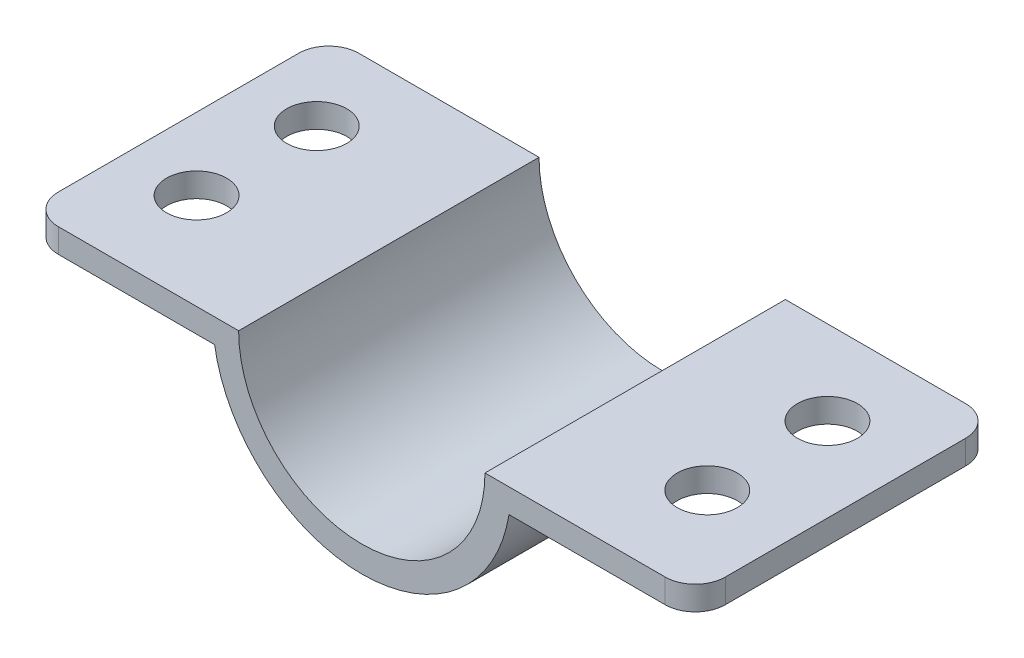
ISO-10303-21;
HEADER;
FILE_DESCRIPTION(('STEP AP214'),'2;1');
FILE_NAME('part.step','',(''),(''),'','','');
FILE_SCHEMA(('AUTOMOTIVE_DESIGN { 1 0 10303 214 1 1 1 1 }'));
ENDSEC;
DATA;
#1=APPLICATION_CONTEXT('core data for automotive mechanical design processes');
#2=APPLICATION_PROTOCOL_DEFINITION('international standard','automotive_design',2000,#1);
#3=PRODUCT_CONTEXT('',#1,'mechanical');
#4=PRODUCT('Part','Part','',(#3));
#5=PRODUCT_RELATED_PRODUCT_CATEGORY('part','',(#4));
#6=PRODUCT_DEFINITION_FORMATION('','',#4);
#7=PRODUCT_DEFINITION_CONTEXT('part definition',#1,'design');
#8=PRODUCT_DEFINITION('design','',#6,#7);
#9=PRODUCT_DEFINITION_SHAPE('','',#8);
#10=(LENGTH_UNIT() NAMED_UNIT(*) SI_UNIT(.MILLI.,.METRE.));
#11=(NAMED_UNIT(*) PLANE_ANGLE_UNIT() SI_UNIT($,.RADIAN.));
#12=(NAMED_UNIT(*) SI_UNIT($,.STERADIAN.) SOLID_ANGLE_UNIT());
#13=UNCERTAINTY_MEASURE_WITH_UNIT(LENGTH_MEASURE(1.E-05),#10,'distance_accuracy_value','');
#14=(GEOMETRIC_REPRESENTATION_CONTEXT(3) GLOBAL_UNCERTAINTY_ASSIGNED_CONTEXT((#13)) GLOBAL_UNIT_ASSIGNED_CONTEXT((#10,
#11,#12)) REPRESENTATION_CONTEXT('',''));
#15=CARTESIAN_POINT('',(0.,0.,0.));
#16=DIRECTION('',(0.,0.,1.));
#17=DIRECTION('',(1.,0.,0.));
#18=AXIS2_PLACEMENT_3D('',#15,#16,#17);
#19=CARTESIAN_POINT('',(-27.75,0.,12.5));
#20=DIRECTION('',(1.,0.,0.));
#21=DIRECTION('',(0.,0.,-1.));
#22=AXIS2_PLACEMENT_3D('',#19,#20,#21);
#23=PLANE('',#22);
#24=DIRECTION('',(0.,0.,-1.));
#25=VECTOR('',#24,1.);
#26=CARTESIAN_POINT('',(-27.75,-2.,12.5));
#27=LINE('',#26,#25);
#28=CARTESIAN_POINT('',(-27.75,-2.,10.));
#29=VERTEX_POINT('',#28);
#30=CARTESIAN_POINT('',(-27.75,-2.,-10.));
#31=VERTEX_POINT('',#30);
#32=EDGE_CURVE('E147',#29,#31,#27,.T.);
#33=ORIENTED_EDGE('',*,*,#32,.F.);
#34=DIRECTION('',(0.,-1.,0.));
#35=VECTOR('',#34,1.);
#36=CARTESIAN_POINT('',(-27.75,0.,10.));
#37=LINE('',#36,#35);
#38=CARTESIAN_POINT('',(-27.75,0.,10.));
#39=VERTEX_POINT('',#38);
#40=EDGE_CURVE('E59',#29,#39,#37,.F.);
#41=ORIENTED_EDGE('',*,*,#40,.T.);
#42=DIRECTION('',(0.,0.,-1.));
#43=VECTOR('',#42,1.);
#44=CARTESIAN_POINT('',(-27.75,0.,12.5));
#45=LINE('',#44,#43);
#46=CARTESIAN_POINT('',(-27.75,0.,-10.));
#47=VERTEX_POINT('',#46);
#48=EDGE_CURVE('E164',#39,#47,#45,.T.);
#49=ORIENTED_EDGE('',*,*,#48,.T.);
#50=DIRECTION('',(0.,-1.,0.));
#51=VECTOR('',#50,1.);
#52=CARTESIAN_POINT('',(-27.75,0.,-10.));
#53=LINE('',#52,#51);
#54=EDGE_CURVE('E218',#47,#31,#53,.T.);
#55=ORIENTED_EDGE('',*,*,#54,.T.);
#56=EDGE_LOOP('',(#33,#41,#49,#55));
#57=FACE_BOUND('',#56,.T.);
#58=ADVANCED_FACE('F38',(#57),#23,.F.);
#59=CARTESIAN_POINT('',(-27.75,-2.,12.5));
#60=DIRECTION('',(0.,1.,0.));
#61=DIRECTION('',(0.,0.,1.));
#62=AXIS2_PLACEMENT_3D('',#59,#60,#61);
#63=PLANE('',#62);
#64=CARTESIAN_POINT('',(-21.75,-2.,4.5));
#65=DIRECTION('',(0.,1.,0.));
#66=DIRECTION('',(0.,0.,1.));
#67=AXIS2_PLACEMENT_3D('',#64,#65,#66);
#68=CIRCLE('',#67,2.49999999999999);
#69=CARTESIAN_POINT('',(-21.75,-2.,6.99999999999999));
#70=VERTEX_POINT('',#69);
#71=EDGE_CURVE('E433',#70,#70,#68,.T.);
#72=ORIENTED_EDGE('',*,*,#71,.T.);
#73=EDGE_LOOP('',(#72));
#74=FACE_BOUND('',#73,.T.);
#75=CARTESIAN_POINT('',(-21.75,-2.,-5.5));
#76=DIRECTION('',(0.,1.,0.));
#77=DIRECTION('',(0.,0.,1.));
#78=AXIS2_PLACEMENT_3D('',#75,#76,#77);
#79=CIRCLE('',#78,2.49999999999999);
#80=CARTESIAN_POINT('',(-21.75,-2.,-3.00000000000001));
#81=VERTEX_POINT('',#80);
#82=EDGE_CURVE('E167',#81,#81,#79,.T.);
#83=ORIENTED_EDGE('',*,*,#82,.T.);
#84=EDGE_LOOP('',(#83));
#85=FACE_BOUND('',#84,.T.);
#86=DIRECTION('',(1.,0.,0.));
#87=VECTOR('',#86,1.);
#88=CARTESIAN_POINT('',(-27.75,-2.,12.5));
#89=LINE('',#88,#87);
#90=CARTESIAN_POINT('',(-25.25,-2.,12.5));
#91=VERTEX_POINT('',#90);
#92=CARTESIAN_POINT('',(-12.25,-1.99999999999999,12.5));
#93=VERTEX_POINT('',#92);
#94=EDGE_CURVE('E127',#91,#93,#89,.T.);
#95=ORIENTED_EDGE('',*,*,#94,.F.);
#96=CARTESIAN_POINT('',(-25.25,-2.,10.));
#97=DIRECTION('',(0.,1.,0.));
#98=DIRECTION('',(0.,0.,1.));
#99=AXIS2_PLACEMENT_3D('',#96,#97,#98);
#100=CIRCLE('',#99,2.5);
#101=EDGE_CURVE('E216',#91,#29,#100,.F.);
#102=ORIENTED_EDGE('',*,*,#101,.T.);
#103=ORIENTED_EDGE('',*,*,#32,.T.);
#104=CARTESIAN_POINT('',(-25.25,-2.,-10.));
#105=DIRECTION('',(0.,1.,0.));
#106=DIRECTION('',(0.,0.,1.));
#107=AXIS2_PLACEMENT_3D('',#104,#105,#106);
#108=CIRCLE('',#107,2.5);
#109=CARTESIAN_POINT('',(-25.25,-2.,-12.5));
#110=VERTEX_POINT('',#109);
#111=EDGE_CURVE('E214',#31,#110,#108,.F.);
#112=ORIENTED_EDGE('',*,*,#111,.T.);
#113=DIRECTION('',(1.,0.,0.));
#114=VECTOR('',#113,1.);
#115=CARTESIAN_POINT('',(-27.75,-2.,-12.5));
#116=LINE('',#115,#114);
#117=CARTESIAN_POINT('',(-12.25,-1.99999999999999,-12.5));
#118=VERTEX_POINT('',#117);
#119=EDGE_CURVE('E144',#110,#118,#116,.T.);
#120=ORIENTED_EDGE('',*,*,#119,.T.);
#121=DIRECTION('',(0.,0.,-1.));
#122=VECTOR('',#121,1.);
#123=CARTESIAN_POINT('',(-12.25,-1.99999999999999,12.5));
#124=LINE('',#123,#122);
#125=EDGE_CURVE('E141',#93,#118,#124,.T.);
#126=ORIENTED_EDGE('',*,*,#125,.F.);
#127=EDGE_LOOP('',(#95,#102,#103,#112,#120,#126));
#128=FACE_BOUND('',#127,.T.);
#129=ADVANCED_FACE('F142',(#74,#85,#128),#63,.F.);
#130=CARTESIAN_POINT('',(0.,0.,12.5));
#131=DIRECTION('',(0.,0.,-1.));
#132=DIRECTION('',(-1.,0.,0.));
#133=AXIS2_PLACEMENT_3D('',#130,#131,#132);
#134=CYLINDRICAL_SURFACE('',#133,12.4121915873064);
#135=CARTESIAN_POINT('',(0.,0.,-12.5));
#136=DIRECTION('',(0.,0.,1.));
#137=DIRECTION('',(1.,0.,0.));
#138=AXIS2_PLACEMENT_3D('',#135,#136,#137);
#139=CIRCLE('',#138,12.4121915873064);
#140=CARTESIAN_POINT('',(12.25,-2.,-12.5));
#141=VERTEX_POINT('',#140);
#142=EDGE_CURVE('E166',#118,#141,#139,.T.);
#143=ORIENTED_EDGE('',*,*,#142,.T.);
#144=DIRECTION('',(0.,0.,-1.));
#145=VECTOR('',#144,1.);
#146=CARTESIAN_POINT('',(12.25,-2.,12.5));
#147=LINE('',#146,#145);
#148=CARTESIAN_POINT('',(12.25,-2.,12.5));
#149=VERTEX_POINT('',#148);
#150=EDGE_CURVE('E148',#149,#141,#147,.T.);
#151=ORIENTED_EDGE('',*,*,#150,.F.);
#152=CARTESIAN_POINT('',(0.,0.,12.5));
#153=DIRECTION('',(0.,0.,1.));
#154=DIRECTION('',(1.,0.,0.));
#155=AXIS2_PLACEMENT_3D('',#152,#153,#154);
#156=CIRCLE('',#155,12.4121915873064);
#157=EDGE_CURVE('E132',#93,#149,#156,.T.);
#158=ORIENTED_EDGE('',*,*,#157,.F.);
#159=ORIENTED_EDGE('',*,*,#125,.T.);
#160=EDGE_LOOP('',(#143,#151,#158,#159));
#161=FACE_BOUND('',#160,.T.);
#162=ADVANCED_FACE('F150',(#161),#134,.T.);
#163=CARTESIAN_POINT('',(27.75,-2.,12.5));
#164=DIRECTION('',(0.,1.,0.));
#165=DIRECTION('',(0.,0.,1.));
#166=AXIS2_PLACEMENT_3D('',#163,#164,#165);
#167=PLANE('',#166);
#168=CARTESIAN_POINT('',(20.75,-2.,4.5));
#169=DIRECTION('',(0.,1.,0.));
#170=DIRECTION('',(0.,0.,1.));
#171=AXIS2_PLACEMENT_3D('',#168,#169,#170);
#172=CIRCLE('',#171,2.5);
#173=CARTESIAN_POINT('',(20.75,-2.,7.));
#174=VERTEX_POINT('',#173);
#175=EDGE_CURVE('E447',#174,#174,#172,.T.);
#176=ORIENTED_EDGE('',*,*,#175,.T.);
#177=EDGE_LOOP('',(#176));
#178=FACE_BOUND('',#177,.T.);
#179=CARTESIAN_POINT('',(20.75,-2.,-5.5));
#180=DIRECTION('',(0.,1.,0.));
#181=DIRECTION('',(0.,0.,1.));
#182=AXIS2_PLACEMENT_3D('',#179,#180,#181);
#183=CIRCLE('',#182,2.5);
#184=CARTESIAN_POINT('',(20.75,-2.,-3.));
#185=VERTEX_POINT('',#184);
#186=EDGE_CURVE('E441',#185,#185,#183,.T.);
#187=ORIENTED_EDGE('',*,*,#186,.T.);
#188=EDGE_LOOP('',(#187));
#189=FACE_BOUND('',#188,.T.);
#190=DIRECTION('',(0.,0.,-1.));
#191=VECTOR('',#190,1.);
#192=CARTESIAN_POINT('',(27.75,-2.,12.5));
#193=LINE('',#192,#191);
#194=CARTESIAN_POINT('',(27.75,-2.,10.));
#195=VERTEX_POINT('',#194);
#196=CARTESIAN_POINT('',(27.75,-2.,-10.));
#197=VERTEX_POINT('',#196);
#198=EDGE_CURVE('E187',#195,#197,#193,.T.);
#199=ORIENTED_EDGE('',*,*,#198,.F.);
#200=CARTESIAN_POINT('',(25.25,-2.,10.));
#201=DIRECTION('',(0.,1.,0.));
#202=DIRECTION('',(0.,0.,1.));
#203=AXIS2_PLACEMENT_3D('',#200,#201,#202);
#204=CIRCLE('',#203,2.5);
#205=CARTESIAN_POINT('',(25.25,-2.,12.5));
#206=VERTEX_POINT('',#205);
#207=EDGE_CURVE('E208',#195,#206,#204,.F.);
#208=ORIENTED_EDGE('',*,*,#207,.T.);
#209=DIRECTION('',(1.,0.,0.));
#210=VECTOR('',#209,1.);
#211=CARTESIAN_POINT('',(27.75,-2.,12.5));
#212=LINE('',#211,#210);
#213=EDGE_CURVE('E153',#149,#206,#212,.T.);
#214=ORIENTED_EDGE('',*,*,#213,.F.);
#215=ORIENTED_EDGE('',*,*,#150,.T.);
#216=DIRECTION('',(1.,0.,0.));
#217=VECTOR('',#216,1.);
#218=CARTESIAN_POINT('',(27.75,-2.,-12.5));
#219=LINE('',#218,#217);
#220=CARTESIAN_POINT('',(25.25,-2.,-12.5));
#221=VERTEX_POINT('',#220);
#222=EDGE_CURVE('E169',#141,#221,#219,.T.);
#223=ORIENTED_EDGE('',*,*,#222,.T.);
#224=CARTESIAN_POINT('',(25.25,-2.,-10.));
#225=DIRECTION('',(0.,1.,0.));
#226=DIRECTION('',(0.,0.,1.));
#227=AXIS2_PLACEMENT_3D('',#224,#225,#226);
#228=CIRCLE('',#227,2.5);
#229=EDGE_CURVE('E206',#221,#197,#228,.F.);
#230=ORIENTED_EDGE('',*,*,#229,.T.);
#231=EDGE_LOOP('',(#199,#208,#214,#215,#223,#230));
#232=FACE_BOUND('',#231,.T.);
#233=ADVANCED_FACE('F268',(#178,#189,#232),#167,.F.);
#234=CARTESIAN_POINT('',(27.75,0.,12.5));
#235=DIRECTION('',(-1.,0.,0.));
#236=DIRECTION('',(0.,0.,1.));
#237=AXIS2_PLACEMENT_3D('',#234,#235,#236);
#238=PLANE('',#237);
#239=DIRECTION('',(0.,0.,-1.));
#240=VECTOR('',#239,1.);
#241=CARTESIAN_POINT('',(27.75,0.,12.5));
#242=LINE('',#241,#240);
#243=CARTESIAN_POINT('',(27.75,0.,10.));
#244=VERTEX_POINT('',#243);
#245=CARTESIAN_POINT('',(27.75,0.,-10.));
#246=VERTEX_POINT('',#245);
#247=EDGE_CURVE('E184',#244,#246,#242,.T.);
#248=ORIENTED_EDGE('',*,*,#247,.F.);
#249=DIRECTION('',(0.,1.,0.));
#250=VECTOR('',#249,1.);
#251=CARTESIAN_POINT('',(27.75,-2.,10.));
#252=LINE('',#251,#250);
#253=EDGE_CURVE('E204',#244,#195,#252,.F.);
#254=ORIENTED_EDGE('',*,*,#253,.T.);
#255=ORIENTED_EDGE('',*,*,#198,.T.);
#256=DIRECTION('',(0.,1.,0.));
#257=VECTOR('',#256,1.);
#258=CARTESIAN_POINT('',(27.75,0.,-10.));
#259=LINE('',#258,#257);
#260=EDGE_CURVE('E201',#197,#246,#259,.T.);
#261=ORIENTED_EDGE('',*,*,#260,.T.);
#262=EDGE_LOOP('',(#248,#254,#255,#261));
#263=FACE_BOUND('',#262,.T.);
#264=ADVANCED_FACE('F273',(#263),#238,.F.);
#265=CARTESIAN_POINT('',(10.25,0.,12.5));
#266=DIRECTION('',(0.,-1.,0.));
#267=DIRECTION('',(0.,0.,-1.));
#268=AXIS2_PLACEMENT_3D('',#265,#266,#267);
#269=PLANE('',#268);
#270=CARTESIAN_POINT('',(20.75,0.,4.5));
#271=DIRECTION('',(0.,1.,0.));
#272=DIRECTION('',(0.,0.,1.));
#273=AXIS2_PLACEMENT_3D('',#270,#271,#272);
#274=CIRCLE('',#273,2.5);
#275=CARTESIAN_POINT('',(20.75,0.,7.));
#276=VERTEX_POINT('',#275);
#277=EDGE_CURVE('E450',#276,#276,#274,.T.);
#278=ORIENTED_EDGE('',*,*,#277,.F.);
#279=EDGE_LOOP('',(#278));
#280=FACE_BOUND('',#279,.T.);
#281=CARTESIAN_POINT('',(20.75,0.,-5.5));
#282=DIRECTION('',(0.,1.,0.));
#283=DIRECTION('',(0.,0.,1.));
#284=AXIS2_PLACEMENT_3D('',#281,#282,#283);
#285=CIRCLE('',#284,2.5);
#286=CARTESIAN_POINT('',(20.75,0.,-3.));
#287=VERTEX_POINT('',#286);
#288=EDGE_CURVE('E444',#287,#287,#285,.T.);
#289=ORIENTED_EDGE('',*,*,#288,.F.);
#290=EDGE_LOOP('',(#289));
#291=FACE_BOUND('',#290,.T.);
#292=DIRECTION('',(-1.,0.,0.));
#293=VECTOR('',#292,1.);
#294=CARTESIAN_POINT('',(10.25,0.,12.5));
#295=LINE('',#294,#293);
#296=CARTESIAN_POINT('',(25.25,0.,12.5));
#297=VERTEX_POINT('',#296);
#298=CARTESIAN_POINT('',(10.25,0.,12.5));
#299=VERTEX_POINT('',#298);
#300=EDGE_CURVE('E155',#297,#299,#295,.T.);
#301=ORIENTED_EDGE('',*,*,#300,.F.);
#302=CARTESIAN_POINT('',(25.25,0.,10.));
#303=DIRECTION('',(0.,-1.,0.));
#304=DIRECTION('',(0.,0.,-1.));
#305=AXIS2_PLACEMENT_3D('',#302,#303,#304);
#306=CIRCLE('',#305,2.5);
#307=EDGE_CURVE('E199',#297,#244,#306,.F.);
#308=ORIENTED_EDGE('',*,*,#307,.T.);
#309=ORIENTED_EDGE('',*,*,#247,.T.);
#310=CARTESIAN_POINT('',(25.25,0.,-10.));
#311=DIRECTION('',(0.,-1.,0.));
#312=DIRECTION('',(0.,0.,-1.));
#313=AXIS2_PLACEMENT_3D('',#310,#311,#312);
#314=CIRCLE('',#313,2.5);
#315=CARTESIAN_POINT('',(25.25,0.,-12.5));
#316=VERTEX_POINT('',#315);
#317=EDGE_CURVE('E197',#246,#316,#314,.F.);
#318=ORIENTED_EDGE('',*,*,#317,.T.);
#319=DIRECTION('',(-1.,0.,0.));
#320=VECTOR('',#319,1.);
#321=CARTESIAN_POINT('',(10.25,0.,-12.5));
#322=LINE('',#321,#320);
#323=CARTESIAN_POINT('',(10.25,0.,-12.5));
#324=VERTEX_POINT('',#323);
#325=EDGE_CURVE('E172',#316,#324,#322,.T.);
#326=ORIENTED_EDGE('',*,*,#325,.T.);
#327=DIRECTION('',(0.,0.,-1.));
#328=VECTOR('',#327,1.);
#329=CARTESIAN_POINT('',(10.25,0.,12.5));
#330=LINE('',#329,#328);
#331=EDGE_CURVE('E181',#299,#324,#330,.T.);
#332=ORIENTED_EDGE('',*,*,#331,.F.);
#333=EDGE_LOOP('',(#301,#308,#309,#318,#326,#332));
#334=FACE_BOUND('',#333,.T.);
#335=ADVANCED_FACE('F277',(#280,#291,#334),#269,.F.);
#336=CARTESIAN_POINT('',(0.,0.,12.5));
#337=DIRECTION('',(0.,0.,-1.));
#338=DIRECTION('',(-1.,0.,0.));
#339=AXIS2_PLACEMENT_3D('',#336,#337,#338);
#340=CYLINDRICAL_SURFACE('',#339,10.25);
#341=CARTESIAN_POINT('',(0.,0.,-12.5));
#342=DIRECTION('',(0.,0.,-1.));
#343=DIRECTION('',(1.,0.,0.));
#344=AXIS2_PLACEMENT_3D('',#341,#342,#343);
#345=CIRCLE('',#344,10.25);
#346=CARTESIAN_POINT('',(-10.25,0.,-12.5));
#347=VERTEX_POINT('',#346);
#348=EDGE_CURVE('E174',#324,#347,#345,.T.);
#349=ORIENTED_EDGE('',*,*,#348,.T.);
#350=DIRECTION('',(0.,0.,-1.));
#351=VECTOR('',#350,1.);
#352=CARTESIAN_POINT('',(-10.25,0.,12.5));
#353=LINE('',#352,#351);
#354=CARTESIAN_POINT('',(-10.25,0.,12.5));
#355=VERTEX_POINT('',#354);
#356=EDGE_CURVE('E178',#355,#347,#353,.T.);
#357=ORIENTED_EDGE('',*,*,#356,.F.);
#358=CARTESIAN_POINT('',(0.,0.,12.5));
#359=DIRECTION('',(0.,0.,-1.));
#360=DIRECTION('',(1.,0.,0.));
#361=AXIS2_PLACEMENT_3D('',#358,#359,#360);
#362=CIRCLE('',#361,10.25);
#363=EDGE_CURVE('E160',#299,#355,#362,.T.);
#364=ORIENTED_EDGE('',*,*,#363,.F.);
#365=ORIENTED_EDGE('',*,*,#331,.T.);
#366=EDGE_LOOP('',(#349,#357,#364,#365));
#367=FACE_BOUND('',#366,.T.);
#368=ADVANCED_FACE('F233',(#367),#340,.F.);
#369=CARTESIAN_POINT('',(-27.75,0.,12.5));
#370=DIRECTION('',(0.,-1.,0.));
#371=DIRECTION('',(0.,0.,-1.));
#372=AXIS2_PLACEMENT_3D('',#369,#370,#371);
#373=PLANE('',#372);
#374=CARTESIAN_POINT('',(-21.75,0.,4.5));
#375=DIRECTION('',(0.,1.,0.));
#376=DIRECTION('',(0.,0.,1.));
#377=AXIS2_PLACEMENT_3D('',#374,#375,#376);
#378=CIRCLE('',#377,2.49999999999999);
#379=CARTESIAN_POINT('',(-21.75,0.,6.99999999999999));
#380=VERTEX_POINT('',#379);
#381=EDGE_CURVE('E438',#380,#380,#378,.T.);
#382=ORIENTED_EDGE('',*,*,#381,.F.);
#383=EDGE_LOOP('',(#382));
#384=FACE_BOUND('',#383,.T.);
#385=CARTESIAN_POINT('',(-21.75,0.,-5.5));
#386=DIRECTION('',(0.,1.,0.));
#387=DIRECTION('',(0.,0.,1.));
#388=AXIS2_PLACEMENT_3D('',#385,#386,#387);
#389=CIRCLE('',#388,2.49999999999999);
#390=CARTESIAN_POINT('',(-21.75,0.,-3.00000000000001));
#391=VERTEX_POINT('',#390);
#392=EDGE_CURVE('E429',#391,#391,#389,.T.);
#393=ORIENTED_EDGE('',*,*,#392,.F.);
#394=EDGE_LOOP('',(#393));
#395=FACE_BOUND('',#394,.T.);
#396=ORIENTED_EDGE('',*,*,#48,.F.);
#397=CARTESIAN_POINT('',(-25.25,0.,10.));
#398=DIRECTION('',(0.,-1.,0.));
#399=DIRECTION('',(0.,0.,-1.));
#400=AXIS2_PLACEMENT_3D('',#397,#398,#399);
#401=CIRCLE('',#400,2.5);
#402=CARTESIAN_POINT('',(-25.25,0.,12.5));
#403=VERTEX_POINT('',#402);
#404=EDGE_CURVE('E11',#39,#403,#401,.F.);
#405=ORIENTED_EDGE('',*,*,#404,.T.);
#406=DIRECTION('',(-1.,0.,0.));
#407=VECTOR('',#406,1.);
#408=CARTESIAN_POINT('',(-27.75,0.,12.5));
#409=LINE('',#408,#407);
#410=EDGE_CURVE('E162',#355,#403,#409,.T.);
#411=ORIENTED_EDGE('',*,*,#410,.F.);
#412=ORIENTED_EDGE('',*,*,#356,.T.);
#413=DIRECTION('',(-1.,0.,0.));
#414=VECTOR('',#413,1.);
#415=CARTESIAN_POINT('',(-27.75,0.,-12.5));
#416=LINE('',#415,#414);
#417=CARTESIAN_POINT('',(-25.25,0.,-12.5));
#418=VERTEX_POINT('',#417);
#419=EDGE_CURVE('E138',#347,#418,#416,.T.);
#420=ORIENTED_EDGE('',*,*,#419,.T.);
#421=CARTESIAN_POINT('',(-25.25,0.,-10.));
#422=DIRECTION('',(0.,-1.,0.));
#423=DIRECTION('',(0.,0.,-1.));
#424=AXIS2_PLACEMENT_3D('',#421,#422,#423);
#425=CIRCLE('',#424,2.5);
#426=EDGE_CURVE('E46',#418,#47,#425,.F.);
#427=ORIENTED_EDGE('',*,*,#426,.T.);
#428=EDGE_LOOP('',(#396,#405,#411,#412,#420,#427));
#429=FACE_BOUND('',#428,.T.);
#430=ADVANCED_FACE('F227',(#384,#395,#429),#373,.F.);
#431=CARTESIAN_POINT('',(0.,0.,12.5));
#432=DIRECTION('',(0.,0.,1.));
#433=DIRECTION('',(1.,0.,0.));
#434=AXIS2_PLACEMENT_3D('',#431,#432,#433);
#435=PLANE('',#434);
#436=ORIENTED_EDGE('',*,*,#213,.T.);
#437=DIRECTION('',(0.,1.,0.));
#438=VECTOR('',#437,1.);
#439=CARTESIAN_POINT('',(25.25,0.,12.5));
#440=LINE('',#439,#438);
#441=EDGE_CURVE('E194',#206,#297,#440,.T.);
#442=ORIENTED_EDGE('',*,*,#441,.T.);
#443=ORIENTED_EDGE('',*,*,#300,.T.);
#444=ORIENTED_EDGE('',*,*,#363,.T.);
#445=ORIENTED_EDGE('',*,*,#410,.T.);
#446=DIRECTION('',(0.,-1.,0.));
#447=VECTOR('',#446,1.);
#448=CARTESIAN_POINT('',(-25.25,-2.,12.5));
#449=LINE('',#448,#447);
#450=EDGE_CURVE('E136',#403,#91,#449,.T.);
#451=ORIENTED_EDGE('',*,*,#450,.T.);
#452=ORIENTED_EDGE('',*,*,#94,.T.);
#453=ORIENTED_EDGE('',*,*,#157,.T.);
#454=EDGE_LOOP('',(#436,#442,#443,#444,#445,#451,#452,#453));
#455=FACE_BOUND('',#454,.T.);
#456=ADVANCED_FACE('F130',(#455),#435,.T.);
#457=CARTESIAN_POINT('',(0.,0.,-12.5));
#458=DIRECTION('',(0.,0.,1.));
#459=DIRECTION('',(1.,0.,0.));
#460=AXIS2_PLACEMENT_3D('',#457,#458,#459);
#461=PLANE('',#460);
#462=ORIENTED_EDGE('',*,*,#325,.F.);
#463=DIRECTION('',(0.,1.,0.));
#464=VECTOR('',#463,1.);
#465=CARTESIAN_POINT('',(25.25,0.,-12.5));
#466=LINE('',#465,#464);
#467=EDGE_CURVE('E212',#316,#221,#466,.F.);
#468=ORIENTED_EDGE('',*,*,#467,.T.);
#469=ORIENTED_EDGE('',*,*,#222,.F.);
#470=ORIENTED_EDGE('',*,*,#142,.F.);
#471=ORIENTED_EDGE('',*,*,#119,.F.);
#472=DIRECTION('',(0.,-1.,0.));
#473=VECTOR('',#472,1.);
#474=CARTESIAN_POINT('',(-25.25,0.,-12.5));
#475=LINE('',#474,#473);
#476=EDGE_CURVE('E210',#110,#418,#475,.F.);
#477=ORIENTED_EDGE('',*,*,#476,.T.);
#478=ORIENTED_EDGE('',*,*,#419,.F.);
#479=ORIENTED_EDGE('',*,*,#348,.F.);
#480=EDGE_LOOP('',(#462,#468,#469,#470,#471,#477,#478,#479));
#481=FACE_BOUND('',#480,.T.);
#482=ADVANCED_FACE('F238',(#481),#461,.F.);
#483=CARTESIAN_POINT('',(-21.75,0.,-5.5));
#484=DIRECTION('',(0.,1.,0.));
#485=DIRECTION('',(0.,0.,1.));
#486=AXIS2_PLACEMENT_3D('',#483,#484,#485);
#487=CYLINDRICAL_SURFACE('',#486,2.49999999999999);
#488=ORIENTED_EDGE('',*,*,#392,.T.);
#489=EDGE_LOOP('',(#488));
#490=FACE_BOUND('',#489,.T.);
#491=ORIENTED_EDGE('',*,*,#82,.F.);
#492=EDGE_LOOP('',(#491));
#493=FACE_BOUND('',#492,.T.);
#494=ADVANCED_FACE('F343',(#490,#493),#487,.F.);
#495=CARTESIAN_POINT('',(-21.75,0.,4.5));
#496=DIRECTION('',(0.,1.,0.));
#497=DIRECTION('',(0.,0.,1.));
#498=AXIS2_PLACEMENT_3D('',#495,#496,#497);
#499=CYLINDRICAL_SURFACE('',#498,2.49999999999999);
#500=ORIENTED_EDGE('',*,*,#381,.T.);
#501=EDGE_LOOP('',(#500));
#502=FACE_BOUND('',#501,.T.);
#503=ORIENTED_EDGE('',*,*,#71,.F.);
#504=EDGE_LOOP('',(#503));
#505=FACE_BOUND('',#504,.T.);
#506=ADVANCED_FACE('F382',(#502,#505),#499,.F.);
#507=CARTESIAN_POINT('',(20.75,0.,-5.5));
#508=DIRECTION('',(0.,1.,0.));
#509=DIRECTION('',(0.,0.,1.));
#510=AXIS2_PLACEMENT_3D('',#507,#508,#509);
#511=CYLINDRICAL_SURFACE('',#510,2.5);
#512=ORIENTED_EDGE('',*,*,#288,.T.);
#513=EDGE_LOOP('',(#512));
#514=FACE_BOUND('',#513,.T.);
#515=ORIENTED_EDGE('',*,*,#186,.F.);
#516=EDGE_LOOP('',(#515));
#517=FACE_BOUND('',#516,.T.);
#518=ADVANCED_FACE('F374',(#514,#517),#511,.F.);
#519=CARTESIAN_POINT('',(20.75,0.,4.5));
#520=DIRECTION('',(0.,1.,0.));
#521=DIRECTION('',(0.,0.,1.));
#522=AXIS2_PLACEMENT_3D('',#519,#520,#521);
#523=CYLINDRICAL_SURFACE('',#522,2.5);
#524=ORIENTED_EDGE('',*,*,#277,.T.);
#525=EDGE_LOOP('',(#524));
#526=FACE_BOUND('',#525,.T.);
#527=ORIENTED_EDGE('',*,*,#175,.F.);
#528=EDGE_LOOP('',(#527));
#529=FACE_BOUND('',#528,.T.);
#530=ADVANCED_FACE('F257',(#526,#529),#523,.F.);
#531=CARTESIAN_POINT('',(25.25,0.,10.));
#532=DIRECTION('',(0.,-1.,0.));
#533=DIRECTION('',(0.,0.,-1.));
#534=AXIS2_PLACEMENT_3D('',#531,#532,#533);
#535=CYLINDRICAL_SURFACE('',#534,2.5);
#536=ORIENTED_EDGE('',*,*,#207,.F.);
#537=ORIENTED_EDGE('',*,*,#253,.F.);
#538=ORIENTED_EDGE('',*,*,#307,.F.);
#539=ORIENTED_EDGE('',*,*,#441,.F.);
#540=EDGE_LOOP('',(#536,#537,#538,#539));
#541=FACE_BOUND('',#540,.T.);
#542=ADVANCED_FACE('F254',(#541),#535,.T.);
#543=CARTESIAN_POINT('',(25.25,0.,-10.));
#544=DIRECTION('',(0.,1.,0.));
#545=DIRECTION('',(0.,0.,1.));
#546=AXIS2_PLACEMENT_3D('',#543,#544,#545);
#547=CYLINDRICAL_SURFACE('',#546,2.5);
#548=ORIENTED_EDGE('',*,*,#229,.F.);
#549=ORIENTED_EDGE('',*,*,#467,.F.);
#550=ORIENTED_EDGE('',*,*,#317,.F.);
#551=ORIENTED_EDGE('',*,*,#260,.F.);
#552=EDGE_LOOP('',(#548,#549,#550,#551));
#553=FACE_BOUND('',#552,.T.);
#554=ADVANCED_FACE('F244',(#553),#547,.T.);
#555=CARTESIAN_POINT('',(-25.25,0.,10.));
#556=DIRECTION('',(0.,1.,0.));
#557=DIRECTION('',(0.,0.,1.));
#558=AXIS2_PLACEMENT_3D('',#555,#556,#557);
#559=CYLINDRICAL_SURFACE('',#558,2.5);
#560=ORIENTED_EDGE('',*,*,#404,.F.);
#561=ORIENTED_EDGE('',*,*,#40,.F.);
#562=ORIENTED_EDGE('',*,*,#101,.F.);
#563=ORIENTED_EDGE('',*,*,#450,.F.);
#564=EDGE_LOOP('',(#560,#561,#562,#563));
#565=FACE_BOUND('',#564,.T.);
#566=ADVANCED_FACE('F225',(#565),#559,.T.);
#567=CARTESIAN_POINT('',(-25.25,0.,-10.));
#568=DIRECTION('',(0.,-1.,0.));
#569=DIRECTION('',(0.,0.,-1.));
#570=AXIS2_PLACEMENT_3D('',#567,#568,#569);
#571=CYLINDRICAL_SURFACE('',#570,2.5);
#572=ORIENTED_EDGE('',*,*,#426,.F.);
#573=ORIENTED_EDGE('',*,*,#476,.F.);
#574=ORIENTED_EDGE('',*,*,#111,.F.);
#575=ORIENTED_EDGE('',*,*,#54,.F.);
#576=EDGE_LOOP('',(#572,#573,#574,#575));
#577=FACE_BOUND('',#576,.T.);
#578=ADVANCED_FACE('F40',(#577),#571,.T.);
#579=CLOSED_SHELL('',(#58,#129,#162,#233,#264,#335,#368,#430,#456,#482,#494,#506,#518,#530,#542,
#554,#566,#578));
#580=MANIFOLD_SOLID_BREP('B2',#579);
#581=ADVANCED_BREP_SHAPE_REPRESENTATION('',(#18,#580),#14);
#582=SHAPE_DEFINITION_REPRESENTATION(#9,#581);
ENDSEC;
END-ISO-10303-21;
